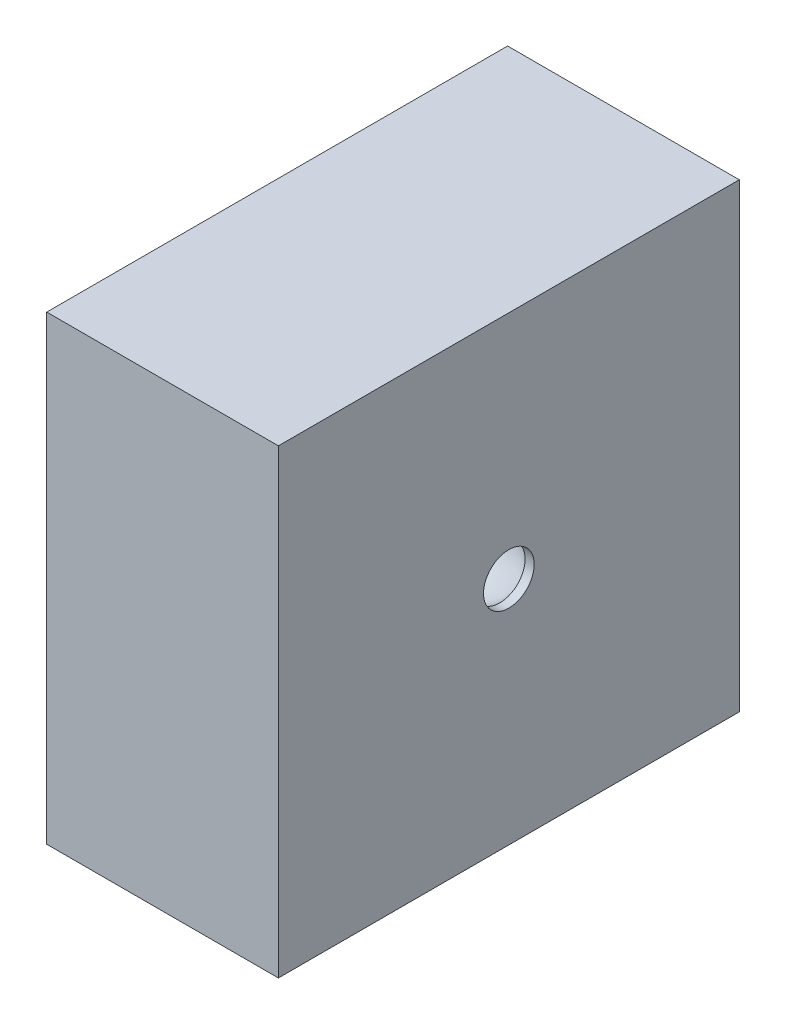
ISO-10303-21;
HEADER;
FILE_DESCRIPTION(('STEP AP214'),'2;1');
FILE_NAME('part.step','',(''),(''),'','','');
FILE_SCHEMA(('AUTOMOTIVE_DESIGN { 1 0 10303 214 1 1 1 1 }'));
ENDSEC;
DATA;
#1=APPLICATION_CONTEXT('core data for automotive mechanical design processes');
#2=APPLICATION_PROTOCOL_DEFINITION('international standard','automotive_design',2000,#1);
#3=PRODUCT_CONTEXT('',#1,'mechanical');
#4=PRODUCT('Part','Part','',(#3));
#5=PRODUCT_RELATED_PRODUCT_CATEGORY('part','',(#4));
#6=PRODUCT_DEFINITION_FORMATION('','',#4);
#7=PRODUCT_DEFINITION_CONTEXT('part definition',#1,'design');
#8=PRODUCT_DEFINITION('design','',#6,#7);
#9=PRODUCT_DEFINITION_SHAPE('','',#8);
#10=(LENGTH_UNIT() NAMED_UNIT(*) SI_UNIT(.MILLI.,.METRE.));
#11=(NAMED_UNIT(*) PLANE_ANGLE_UNIT() SI_UNIT($,.RADIAN.));
#12=(NAMED_UNIT(*) SI_UNIT($,.STERADIAN.) SOLID_ANGLE_UNIT());
#13=UNCERTAINTY_MEASURE_WITH_UNIT(LENGTH_MEASURE(1.E-05),#10,'distance_accuracy_value','');
#14=(GEOMETRIC_REPRESENTATION_CONTEXT(3) GLOBAL_UNCERTAINTY_ASSIGNED_CONTEXT((#13)) GLOBAL_UNIT_ASSIGNED_CONTEXT((#10,
#11,#12)) REPRESENTATION_CONTEXT('',''));
#15=CARTESIAN_POINT('',(0.,0.,0.));
#16=DIRECTION('',(0.,0.,1.));
#17=DIRECTION('',(1.,0.,0.));
#18=AXIS2_PLACEMENT_3D('',#15,#16,#17);
#19=CARTESIAN_POINT('',(-6.6446004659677,0.,0.));
#20=DIRECTION('',(1.,0.,0.));
#21=DIRECTION('',(0.,0.,-1.));
#22=AXIS2_PLACEMENT_3D('',#19,#20,#21);
#23=DEGENERATE_TOROIDAL_SURFACE('',#22,4.93992013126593,9.57470799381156,.F.);
#24=CARTESIAN_POINT('',(-1.00000016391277,0.,0.));
#25=DIRECTION('',(1.,0.,0.));
#26=DIRECTION('',(0.,0.,-1.));
#27=AXIS2_PLACEMENT_3D('',#24,#25,#26);
#28=CIRCLE('',#27,2.794);
#29=CARTESIAN_POINT('',(-1.00000016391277,0.,-2.794));
#30=VERTEX_POINT('',#29);
#31=EDGE_CURVE('E54',#30,#30,#28,.T.);
#32=ORIENTED_EDGE('',*,*,#31,.T.);
#33=EDGE_LOOP('',(#32));
#34=FACE_BOUND('',#33,.T.);
#35=CARTESIAN_POINT('',(-6.48640049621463,0.,0.));
#36=DIRECTION('',(1.,0.,0.));
#37=DIRECTION('',(0.,0.,-1.));
#38=AXIS2_PLACEMENT_3D('',#35,#36,#37);
#39=CIRCLE('',#38,4.63348082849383);
#40=CARTESIAN_POINT('',(-6.48640049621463,0.,-4.63348082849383));
#41=VERTEX_POINT('',#40);
#42=EDGE_CURVE('E11',#41,#41,#39,.T.);
#43=ORIENTED_EDGE('',*,*,#42,.F.);
#44=EDGE_LOOP('',(#43));
#45=FACE_BOUND('',#44,.T.);
#46=ADVANCED_FACE('F45',(#34,#45),#23,.T.);
#47=CARTESIAN_POINT('',(0.,0.,0.));
#48=DIRECTION('',(1.,0.,0.));
#49=DIRECTION('',(0.,0.,-1.));
#50=AXIS2_PLACEMENT_3D('',#47,#48,#49);
#51=CYLINDRICAL_SURFACE('',#50,2.794);
#52=CARTESIAN_POINT('',(1.22508245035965E-05,0.,0.));
#53=DIRECTION('',(1.,0.,0.));
#54=DIRECTION('',(0.,0.,-1.));
#55=AXIS2_PLACEMENT_3D('',#52,#53,#54);
#56=CIRCLE('',#55,2.794);
#57=CARTESIAN_POINT('',(1.22508245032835E-05,0.,-2.794));
#58=VERTEX_POINT('',#57);
#59=EDGE_CURVE('E120',#58,#58,#56,.T.);
#60=ORIENTED_EDGE('',*,*,#59,.T.);
#61=EDGE_LOOP('',(#60));
#62=FACE_BOUND('',#61,.T.);
#63=ORIENTED_EDGE('',*,*,#31,.F.);
#64=EDGE_LOOP('',(#63));
#65=FACE_BOUND('',#64,.T.);
#66=ADVANCED_FACE('F147',(#62,#65),#51,.F.);
#67=CARTESIAN_POINT('',(1.22508245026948E-05,0.,-5.56012443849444));
#68=DIRECTION('',(1.,0.,0.));
#69=DIRECTION('',(0.,0.,-1.));
#70=AXIS2_PLACEMENT_3D('',#67,#68,#69);
#71=PLANE('',#70);
#72=ORIENTED_EDGE('',*,*,#59,.F.);
#73=EDGE_LOOP('',(#72));
#74=FACE_BOUND('',#73,.T.);
#75=DIRECTION('',(0.,1.,0.));
#76=VECTOR('',#75,1.);
#77=CARTESIAN_POINT('',(1.2250824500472E-05,-25.4,-25.4));
#78=LINE('',#77,#76);
#79=CARTESIAN_POINT('',(1.2250824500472E-05,-25.4,-25.4));
#80=VERTEX_POINT('',#79);
#81=CARTESIAN_POINT('',(1.2250824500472E-05,25.4,-25.4));
#82=VERTEX_POINT('',#81);
#83=EDGE_CURVE('E128',#80,#82,#78,.T.);
#84=ORIENTED_EDGE('',*,*,#83,.T.);
#85=DIRECTION('',(0.,0.,1.));
#86=VECTOR('',#85,1.);
#87=CARTESIAN_POINT('',(1.22508245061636E-05,25.4,25.4));
#88=LINE('',#87,#86);
#89=CARTESIAN_POINT('',(1.22508245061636E-05,25.4,25.4));
#90=VERTEX_POINT('',#89);
#91=EDGE_CURVE('E124',#82,#90,#88,.T.);
#92=ORIENTED_EDGE('',*,*,#91,.T.);
#93=DIRECTION('',(0.,-1.,0.));
#94=VECTOR('',#93,1.);
#95=CARTESIAN_POINT('',(1.22508245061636E-05,-25.4,25.4));
#96=LINE('',#95,#94);
#97=CARTESIAN_POINT('',(1.22508245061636E-05,-25.4,25.4));
#98=VERTEX_POINT('',#97);
#99=EDGE_CURVE('E121',#90,#98,#96,.T.);
#100=ORIENTED_EDGE('',*,*,#99,.T.);
#101=DIRECTION('',(0.,0.,-1.));
#102=VECTOR('',#101,1.);
#103=CARTESIAN_POINT('',(1.22508245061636E-05,-25.4,25.4));
#104=LINE('',#103,#102);
#105=EDGE_CURVE('E89',#98,#80,#104,.T.);
#106=ORIENTED_EDGE('',*,*,#105,.T.);
#107=EDGE_LOOP('',(#84,#92,#100,#106));
#108=FACE_BOUND('',#107,.T.);
#109=ADVANCED_FACE('F149',(#74,#108),#71,.T.);
#110=CARTESIAN_POINT('',(-78.3284494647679,-25.4,-25.4));
#111=DIRECTION('',(0.,0.,-1.));
#112=DIRECTION('',(-1.,0.,0.));
#113=AXIS2_PLACEMENT_3D('',#110,#111,#112);
#114=PLANE('',#113);
#115=DIRECTION('',(1.,0.,0.));
#116=VECTOR('',#115,1.);
#117=CARTESIAN_POINT('',(-78.3284494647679,-25.4,-25.4));
#118=LINE('',#117,#116);
#119=CARTESIAN_POINT('',(-25.5364004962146,-25.4,-25.4));
#120=VERTEX_POINT('',#119);
#121=EDGE_CURVE('E93',#120,#80,#118,.T.);
#122=ORIENTED_EDGE('',*,*,#121,.F.);
#123=DIRECTION('',(0.,-1.,0.));
#124=VECTOR('',#123,1.);
#125=CARTESIAN_POINT('',(-25.5364004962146,-25.4,-25.4));
#126=LINE('',#125,#124);
#127=CARTESIAN_POINT('',(-25.5364004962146,25.4,-25.4));
#128=VERTEX_POINT('',#127);
#129=EDGE_CURVE('E106',#128,#120,#126,.T.);
#130=ORIENTED_EDGE('',*,*,#129,.F.);
#131=DIRECTION('',(1.,0.,0.));
#132=VECTOR('',#131,1.);
#133=CARTESIAN_POINT('',(-78.3284494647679,25.4,-25.4));
#134=LINE('',#133,#132);
#135=EDGE_CURVE('E117',#128,#82,#134,.T.);
#136=ORIENTED_EDGE('',*,*,#135,.T.);
#137=ORIENTED_EDGE('',*,*,#83,.F.);
#138=EDGE_LOOP('',(#122,#130,#136,#137));
#139=FACE_BOUND('',#138,.T.);
#140=ADVANCED_FACE('F155',(#139),#114,.T.);
#141=CARTESIAN_POINT('',(-78.3284494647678,-25.4,25.4));
#142=DIRECTION('',(0.,-1.,0.));
#143=DIRECTION('',(0.,0.,-1.));
#144=AXIS2_PLACEMENT_3D('',#141,#142,#143);
#145=PLANE('',#144);
#146=DIRECTION('',(1.,0.,0.));
#147=VECTOR('',#146,1.);
#148=CARTESIAN_POINT('',(-78.3284494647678,-25.4,25.4));
#149=LINE('',#148,#147);
#150=CARTESIAN_POINT('',(-25.5364004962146,-25.4,25.4));
#151=VERTEX_POINT('',#150);
#152=EDGE_CURVE('E82',#151,#98,#149,.T.);
#153=ORIENTED_EDGE('',*,*,#152,.F.);
#154=DIRECTION('',(0.,0.,1.));
#155=VECTOR('',#154,1.);
#156=CARTESIAN_POINT('',(-25.5364004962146,-25.4,-25.4));
#157=LINE('',#156,#155);
#158=EDGE_CURVE('E86',#120,#151,#157,.T.);
#159=ORIENTED_EDGE('',*,*,#158,.F.);
#160=ORIENTED_EDGE('',*,*,#121,.T.);
#161=ORIENTED_EDGE('',*,*,#105,.F.);
#162=EDGE_LOOP('',(#153,#159,#160,#161));
#163=FACE_BOUND('',#162,.T.);
#164=ADVANCED_FACE('F84',(#163),#145,.T.);
#165=CARTESIAN_POINT('',(-78.3284494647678,-25.4,25.4));
#166=DIRECTION('',(0.,0.,1.));
#167=DIRECTION('',(1.,0.,0.));
#168=AXIS2_PLACEMENT_3D('',#165,#166,#167);
#169=PLANE('',#168);
#170=DIRECTION('',(1.,0.,0.));
#171=VECTOR('',#170,1.);
#172=CARTESIAN_POINT('',(-78.3284494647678,25.4,25.4));
#173=LINE('',#172,#171);
#174=CARTESIAN_POINT('',(-25.5364004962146,25.4,25.4));
#175=VERTEX_POINT('',#174);
#176=EDGE_CURVE('E61',#175,#90,#173,.T.);
#177=ORIENTED_EDGE('',*,*,#176,.F.);
#178=DIRECTION('',(0.,1.,0.));
#179=VECTOR('',#178,1.);
#180=CARTESIAN_POINT('',(-25.5364004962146,-25.4,25.4));
#181=LINE('',#180,#179);
#182=EDGE_CURVE('E96',#151,#175,#181,.T.);
#183=ORIENTED_EDGE('',*,*,#182,.F.);
#184=ORIENTED_EDGE('',*,*,#152,.T.);
#185=ORIENTED_EDGE('',*,*,#99,.F.);
#186=EDGE_LOOP('',(#177,#183,#184,#185));
#187=FACE_BOUND('',#186,.T.);
#188=ADVANCED_FACE('F97',(#187),#169,.T.);
#189=CARTESIAN_POINT('',(-78.3284494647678,25.4,25.4));
#190=DIRECTION('',(0.,1.,0.));
#191=DIRECTION('',(0.,0.,1.));
#192=AXIS2_PLACEMENT_3D('',#189,#190,#191);
#193=PLANE('',#192);
#194=ORIENTED_EDGE('',*,*,#135,.F.);
#195=DIRECTION('',(0.,0.,-1.));
#196=VECTOR('',#195,1.);
#197=CARTESIAN_POINT('',(-25.5364004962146,25.4,-25.4));
#198=LINE('',#197,#196);
#199=EDGE_CURVE('E102',#175,#128,#198,.T.);
#200=ORIENTED_EDGE('',*,*,#199,.F.);
#201=ORIENTED_EDGE('',*,*,#176,.T.);
#202=ORIENTED_EDGE('',*,*,#91,.F.);
#203=EDGE_LOOP('',(#194,#200,#201,#202));
#204=FACE_BOUND('',#203,.T.);
#205=ADVANCED_FACE('F166',(#204),#193,.T.);
#206=CARTESIAN_POINT('',(-25.5364004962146,4.89267500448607,0.));
#207=DIRECTION('',(-1.,0.,0.));
#208=DIRECTION('',(0.,-1.,0.));
#209=AXIS2_PLACEMENT_3D('',#206,#207,#208);
#210=PLANE('',#209);
#211=CARTESIAN_POINT('',(-25.5364004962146,0.,0.));
#212=DIRECTION('',(1.,0.,0.));
#213=DIRECTION('',(0.,1.,0.));
#214=AXIS2_PLACEMENT_3D('',#211,#212,#213);
#215=CIRCLE('',#214,4.89267500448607);
#216=CARTESIAN_POINT('',(-25.5364004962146,4.89267500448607,0.));
#217=VERTEX_POINT('',#216);
#218=EDGE_CURVE('E101',#217,#217,#215,.T.);
#219=ORIENTED_EDGE('',*,*,#218,.T.);
#220=EDGE_LOOP('',(#219));
#221=FACE_BOUND('',#220,.T.);
#222=ORIENTED_EDGE('',*,*,#158,.T.);
#223=ORIENTED_EDGE('',*,*,#182,.T.);
#224=ORIENTED_EDGE('',*,*,#199,.T.);
#225=ORIENTED_EDGE('',*,*,#129,.T.);
#226=EDGE_LOOP('',(#222,#223,#224,#225));
#227=FACE_BOUND('',#226,.T.);
#228=ADVANCED_FACE('F104',(#221,#227),#210,.T.);
#229=CARTESIAN_POINT('',(-25.5364004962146,0.,0.));
#230=DIRECTION('',(-1.,0.,0.));
#231=DIRECTION('',(0.,-1.,0.));
#232=AXIS2_PLACEMENT_3D('',#229,#230,#231);
#233=CONICAL_SURFACE('',#232,4.89267500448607,0.0136051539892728);
#234=ORIENTED_EDGE('',*,*,#42,.T.);
#235=EDGE_LOOP('',(#234));
#236=FACE_BOUND('',#235,.T.);
#237=ORIENTED_EDGE('',*,*,#218,.F.);
#238=EDGE_LOOP('',(#237));
#239=FACE_BOUND('',#238,.T.);
#240=ADVANCED_FACE('F171',(#236,#239),#233,.F.);
#241=CLOSED_SHELL('',(#46,#66,#109,#140,#164,#188,#205,#228,#240));
#242=MANIFOLD_SOLID_BREP('B2',#241);
#243=ADVANCED_BREP_SHAPE_REPRESENTATION('',(#18,#242),#14);
#244=SHAPE_DEFINITION_REPRESENTATION(#9,#243);
ENDSEC;
END-ISO-10303-21;
